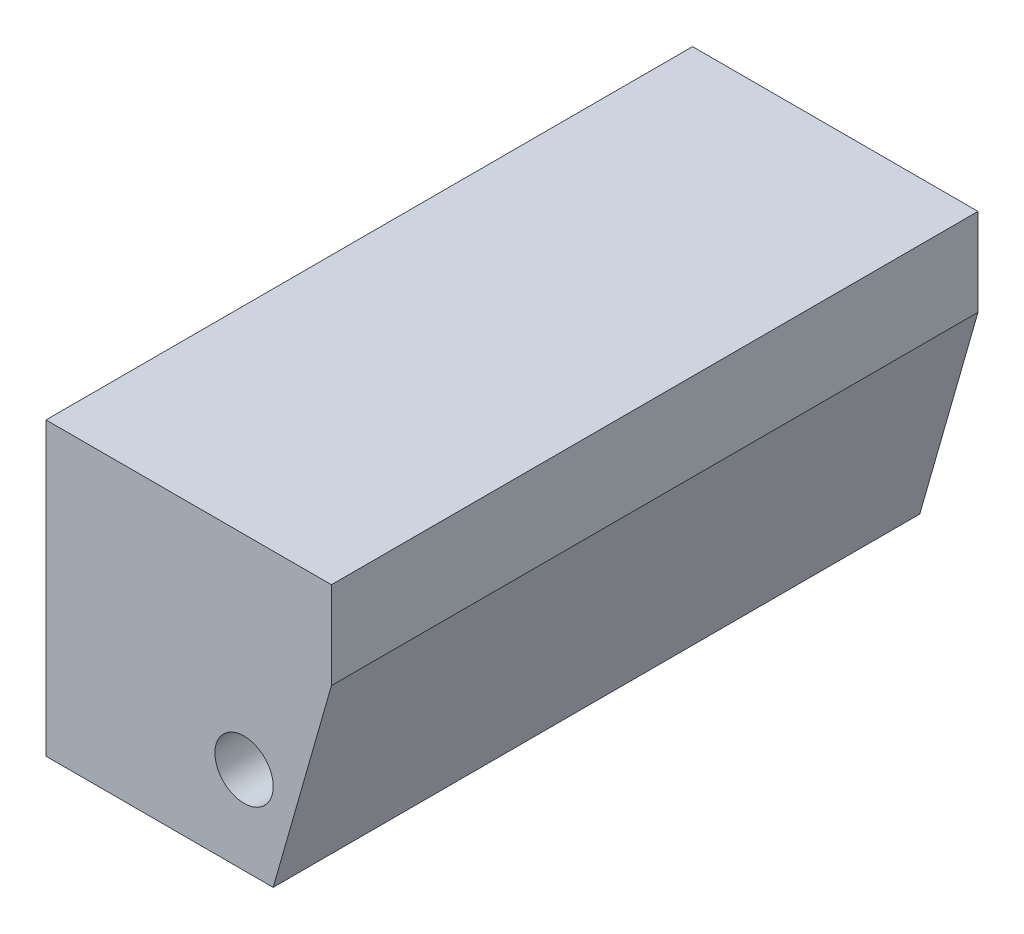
ISO-10303-21;
HEADER;
FILE_DESCRIPTION(('STEP AP214'),'2;1');
FILE_NAME('part.step','',(''),(''),'','','');
FILE_SCHEMA(('AUTOMOTIVE_DESIGN { 1 0 10303 214 1 1 1 1 }'));
ENDSEC;
DATA;
#1=APPLICATION_CONTEXT('core data for automotive mechanical design processes');
#2=APPLICATION_PROTOCOL_DEFINITION('international standard','automotive_design',2000,#1);
#3=PRODUCT_CONTEXT('',#1,'mechanical');
#4=PRODUCT('Part','Part','',(#3));
#5=PRODUCT_RELATED_PRODUCT_CATEGORY('part','',(#4));
#6=PRODUCT_DEFINITION_FORMATION('','',#4);
#7=PRODUCT_DEFINITION_CONTEXT('part definition',#1,'design');
#8=PRODUCT_DEFINITION('design','',#6,#7);
#9=PRODUCT_DEFINITION_SHAPE('','',#8);
#10=(LENGTH_UNIT() NAMED_UNIT(*) SI_UNIT(.MILLI.,.METRE.));
#11=(NAMED_UNIT(*) PLANE_ANGLE_UNIT() SI_UNIT($,.RADIAN.));
#12=(NAMED_UNIT(*) SI_UNIT($,.STERADIAN.) SOLID_ANGLE_UNIT());
#13=UNCERTAINTY_MEASURE_WITH_UNIT(LENGTH_MEASURE(1.E-05),#10,'distance_accuracy_value','');
#14=(GEOMETRIC_REPRESENTATION_CONTEXT(3) GLOBAL_UNCERTAINTY_ASSIGNED_CONTEXT((#13)) GLOBAL_UNIT_ASSIGNED_CONTEXT((#10,
#11,#12)) REPRESENTATION_CONTEXT('',''));
#15=CARTESIAN_POINT('',(0.,0.,0.));
#16=DIRECTION('',(0.,0.,1.));
#17=DIRECTION('',(1.,0.,0.));
#18=AXIS2_PLACEMENT_3D('',#15,#16,#17);
#19=CARTESIAN_POINT('',(0.,50.,0.));
#20=DIRECTION('',(1.,0.,0.));
#21=DIRECTION('',(0.,0.,-1.));
#22=AXIS2_PLACEMENT_3D('',#19,#20,#21);
#23=PLANE('',#22);
#24=DIRECTION('',(0.,0.,1.));
#25=VECTOR('',#24,1.);
#26=CARTESIAN_POINT('',(0.,0.,0.));
#27=LINE('',#26,#25);
#28=CARTESIAN_POINT('',(0.,0.,-111.));
#29=VERTEX_POINT('',#28);
#30=CARTESIAN_POINT('',(0.,0.,0.));
#31=VERTEX_POINT('',#30);
#32=EDGE_CURVE('E113',#29,#31,#27,.T.);
#33=ORIENTED_EDGE('',*,*,#32,.T.);
#34=DIRECTION('',(0.,-1.,0.));
#35=VECTOR('',#34,1.);
#36=CARTESIAN_POINT('',(0.,50.,0.));
#37=LINE('',#36,#35);
#38=CARTESIAN_POINT('',(0.,50.,0.));
#39=VERTEX_POINT('',#38);
#40=EDGE_CURVE('E41',#39,#31,#37,.T.);
#41=ORIENTED_EDGE('',*,*,#40,.F.);
#42=DIRECTION('',(0.,0.,1.));
#43=VECTOR('',#42,1.);
#44=CARTESIAN_POINT('',(0.,50.,0.));
#45=LINE('',#44,#43);
#46=CARTESIAN_POINT('',(0.,50.,-111.));
#47=VERTEX_POINT('',#46);
#48=EDGE_CURVE('E111',#47,#39,#45,.T.);
#49=ORIENTED_EDGE('',*,*,#48,.F.);
#50=DIRECTION('',(0.,-1.,0.));
#51=VECTOR('',#50,1.);
#52=CARTESIAN_POINT('',(0.,50.,-111.));
#53=LINE('',#52,#51);
#54=EDGE_CURVE('E106',#47,#29,#53,.T.);
#55=ORIENTED_EDGE('',*,*,#54,.T.);
#56=EDGE_LOOP('',(#33,#41,#49,#55));
#57=FACE_BOUND('',#56,.T.);
#58=ADVANCED_FACE('F33',(#57),#23,.F.);
#59=CARTESIAN_POINT('',(0.,50.,0.));
#60=DIRECTION('',(0.,0.,-1.));
#61=DIRECTION('',(-1.,0.,0.));
#62=AXIS2_PLACEMENT_3D('',#59,#60,#61);
#63=PLANE('',#62);
#64=CARTESIAN_POINT('',(34.,15.,0.));
#65=DIRECTION('',(0.,0.,1.));
#66=DIRECTION('',(1.,0.,0.));
#67=AXIS2_PLACEMENT_3D('',#64,#65,#66);
#68=CIRCLE('',#67,5.005);
#69=CARTESIAN_POINT('',(39.005,15.,0.));
#70=VERTEX_POINT('',#69);
#71=EDGE_CURVE('E121',#70,#70,#68,.T.);
#72=ORIENTED_EDGE('',*,*,#71,.F.);
#73=EDGE_LOOP('',(#72));
#74=FACE_BOUND('',#73,.T.);
#75=DIRECTION('',(1.,0.,0.));
#76=VECTOR('',#75,1.);
#77=CARTESIAN_POINT('',(0.,0.,0.));
#78=LINE('',#77,#76);
#79=CARTESIAN_POINT('',(39.,0.,0.));
#80=VERTEX_POINT('',#79);
#81=EDGE_CURVE('E99',#31,#80,#78,.T.);
#82=ORIENTED_EDGE('',*,*,#81,.T.);
#83=DIRECTION('',(-0.274721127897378,-0.961523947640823,0.));
#84=VECTOR('',#83,1.);
#85=CARTESIAN_POINT('',(49.,35.,0.));
#86=LINE('',#85,#84);
#87=CARTESIAN_POINT('',(49.,35.,0.));
#88=VERTEX_POINT('',#87);
#89=EDGE_CURVE('E47',#88,#80,#86,.T.);
#90=ORIENTED_EDGE('',*,*,#89,.F.);
#91=DIRECTION('',(0.,-1.,0.));
#92=VECTOR('',#91,1.);
#93=CARTESIAN_POINT('',(49.,50.,0.));
#94=LINE('',#93,#92);
#95=CARTESIAN_POINT('',(49.,50.,0.));
#96=VERTEX_POINT('',#95);
#97=EDGE_CURVE('E97',#96,#88,#94,.T.);
#98=ORIENTED_EDGE('',*,*,#97,.F.);
#99=DIRECTION('',(1.,0.,0.));
#100=VECTOR('',#99,1.);
#101=CARTESIAN_POINT('',(0.,50.,0.));
#102=LINE('',#101,#100);
#103=EDGE_CURVE('E79',#39,#96,#102,.T.);
#104=ORIENTED_EDGE('',*,*,#103,.F.);
#105=ORIENTED_EDGE('',*,*,#40,.T.);
#106=EDGE_LOOP('',(#82,#90,#98,#104,#105));
#107=FACE_BOUND('',#106,.T.);
#108=ADVANCED_FACE('F96',(#74,#107),#63,.F.);
#109=CARTESIAN_POINT('',(49.,50.,0.));
#110=DIRECTION('',(-1.,0.,0.));
#111=DIRECTION('',(0.,0.,1.));
#112=AXIS2_PLACEMENT_3D('',#109,#110,#111);
#113=PLANE('',#112);
#114=ORIENTED_EDGE('',*,*,#97,.T.);
#115=DIRECTION('',(0.,0.,1.));
#116=VECTOR('',#115,1.);
#117=CARTESIAN_POINT('',(49.,35.,-125.5));
#118=LINE('',#117,#116);
#119=CARTESIAN_POINT('',(49.,35.,-111.));
#120=VERTEX_POINT('',#119);
#121=EDGE_CURVE('E87',#120,#88,#118,.T.);
#122=ORIENTED_EDGE('',*,*,#121,.F.);
#123=DIRECTION('',(0.,-1.,0.));
#124=VECTOR('',#123,1.);
#125=CARTESIAN_POINT('',(49.,50.,-111.));
#126=LINE('',#125,#124);
#127=CARTESIAN_POINT('',(49.,50.,-111.));
#128=VERTEX_POINT('',#127);
#129=EDGE_CURVE('E103',#128,#120,#126,.T.);
#130=ORIENTED_EDGE('',*,*,#129,.F.);
#131=DIRECTION('',(0.,0.,-1.));
#132=VECTOR('',#131,1.);
#133=CARTESIAN_POINT('',(49.,50.,0.));
#134=LINE('',#133,#132);
#135=EDGE_CURVE('E102',#96,#128,#134,.T.);
#136=ORIENTED_EDGE('',*,*,#135,.F.);
#137=EDGE_LOOP('',(#114,#122,#130,#136));
#138=FACE_BOUND('',#137,.T.);
#139=ADVANCED_FACE('F101',(#138),#113,.F.);
#140=CARTESIAN_POINT('',(0.,50.,-111.));
#141=DIRECTION('',(0.,0.,1.));
#142=DIRECTION('',(1.,0.,0.));
#143=AXIS2_PLACEMENT_3D('',#140,#141,#142);
#144=PLANE('',#143);
#145=CARTESIAN_POINT('',(34.,15.,-111.));
#146=DIRECTION('',(0.,0.,1.));
#147=DIRECTION('',(1.,0.,0.));
#148=AXIS2_PLACEMENT_3D('',#145,#146,#147);
#149=CIRCLE('',#148,5.005);
#150=CARTESIAN_POINT('',(39.005,15.,-111.));
#151=VERTEX_POINT('',#150);
#152=EDGE_CURVE('E36',#151,#151,#149,.T.);
#153=ORIENTED_EDGE('',*,*,#152,.T.);
#154=EDGE_LOOP('',(#153));
#155=FACE_BOUND('',#154,.T.);
#156=ORIENTED_EDGE('',*,*,#129,.T.);
#157=DIRECTION('',(-0.274721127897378,-0.961523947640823,0.));
#158=VECTOR('',#157,1.);
#159=CARTESIAN_POINT('',(49.2641509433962,35.9245283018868,-111.));
#160=LINE('',#159,#158);
#161=CARTESIAN_POINT('',(39.,0.,-111.));
#162=VERTEX_POINT('',#161);
#163=EDGE_CURVE('E89',#120,#162,#160,.T.);
#164=ORIENTED_EDGE('',*,*,#163,.T.);
#165=DIRECTION('',(-1.,0.,0.));
#166=VECTOR('',#165,1.);
#167=CARTESIAN_POINT('',(0.,0.,-111.));
#168=LINE('',#167,#166);
#169=EDGE_CURVE('E71',#162,#29,#168,.T.);
#170=ORIENTED_EDGE('',*,*,#169,.T.);
#171=ORIENTED_EDGE('',*,*,#54,.F.);
#172=DIRECTION('',(-1.,0.,0.));
#173=VECTOR('',#172,1.);
#174=CARTESIAN_POINT('',(0.,50.,-111.));
#175=LINE('',#174,#173);
#176=EDGE_CURVE('E56',#128,#47,#175,.T.);
#177=ORIENTED_EDGE('',*,*,#176,.F.);
#178=EDGE_LOOP('',(#156,#164,#170,#171,#177));
#179=FACE_BOUND('',#178,.T.);
#180=ADVANCED_FACE('F128',(#155,#179),#144,.F.);
#181=CARTESIAN_POINT('',(0.,50.,0.));
#182=DIRECTION('',(0.,-1.,0.));
#183=DIRECTION('',(0.,0.,-1.));
#184=AXIS2_PLACEMENT_3D('',#181,#182,#183);
#185=PLANE('',#184);
#186=ORIENTED_EDGE('',*,*,#48,.T.);
#187=ORIENTED_EDGE('',*,*,#103,.T.);
#188=ORIENTED_EDGE('',*,*,#135,.T.);
#189=ORIENTED_EDGE('',*,*,#176,.T.);
#190=EDGE_LOOP('',(#186,#187,#188,#189));
#191=FACE_BOUND('',#190,.T.);
#192=ADVANCED_FACE('F148',(#191),#185,.F.);
#193=CARTESIAN_POINT('',(0.,0.,0.));
#194=DIRECTION('',(0.,-1.,0.));
#195=DIRECTION('',(0.,0.,-1.));
#196=AXIS2_PLACEMENT_3D('',#193,#194,#195);
#197=PLANE('',#196);
#198=DIRECTION('',(0.,0.,-1.));
#199=VECTOR('',#198,1.);
#200=CARTESIAN_POINT('',(39.,0.,0.));
#201=LINE('',#200,#199);
#202=EDGE_CURVE('E11',#80,#162,#201,.T.);
#203=ORIENTED_EDGE('',*,*,#202,.F.);
#204=ORIENTED_EDGE('',*,*,#81,.F.);
#205=ORIENTED_EDGE('',*,*,#32,.F.);
#206=ORIENTED_EDGE('',*,*,#169,.F.);
#207=EDGE_LOOP('',(#203,#204,#205,#206));
#208=FACE_BOUND('',#207,.T.);
#209=ADVANCED_FACE('F136',(#208),#197,.T.);
#210=CARTESIAN_POINT('',(49.,35.,-125.5));
#211=DIRECTION('',(-0.961523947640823,0.274721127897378,0.));
#212=DIRECTION('',(-0.274721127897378,-0.961523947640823,0.));
#213=AXIS2_PLACEMENT_3D('',#210,#211,#212);
#214=PLANE('',#213);
#215=ORIENTED_EDGE('',*,*,#121,.T.);
#216=ORIENTED_EDGE('',*,*,#89,.T.);
#217=ORIENTED_EDGE('',*,*,#202,.T.);
#218=ORIENTED_EDGE('',*,*,#163,.F.);
#219=EDGE_LOOP('',(#215,#216,#217,#218));
#220=FACE_BOUND('',#219,.T.);
#221=ADVANCED_FACE('F88',(#220),#214,.F.);
#222=CARTESIAN_POINT('',(34.,15.,-125.5));
#223=DIRECTION('',(0.,0.,1.));
#224=DIRECTION('',(1.,0.,0.));
#225=AXIS2_PLACEMENT_3D('',#222,#223,#224);
#226=CYLINDRICAL_SURFACE('',#225,5.005);
#227=ORIENTED_EDGE('',*,*,#71,.T.);
#228=EDGE_LOOP('',(#227));
#229=FACE_BOUND('',#228,.T.);
#230=ORIENTED_EDGE('',*,*,#152,.F.);
#231=EDGE_LOOP('',(#230));
#232=FACE_BOUND('',#231,.T.);
#233=ADVANCED_FACE('F130',(#229,#232),#226,.F.);
#234=CLOSED_SHELL('',(#58,#108,#139,#180,#192,#209,#221,#233));
#235=MANIFOLD_SOLID_BREP('B2',#234);
#236=ADVANCED_BREP_SHAPE_REPRESENTATION('',(#18,#235),#14);
#237=SHAPE_DEFINITION_REPRESENTATION(#9,#236);
ENDSEC;
END-ISO-10303-21;
